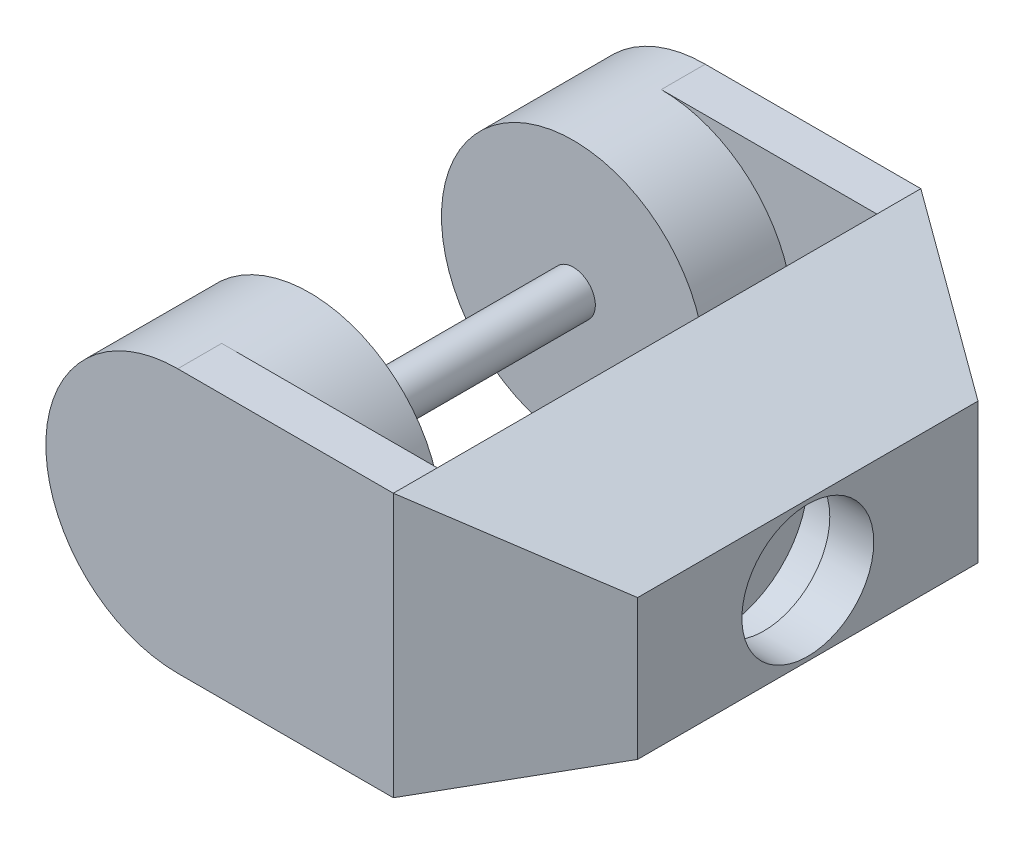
ISO-10303-21;
HEADER;
FILE_DESCRIPTION(('STEP AP214'),'2;1');
FILE_NAME('part.step','',(''),(''),'','','');
FILE_SCHEMA(('AUTOMOTIVE_DESIGN { 1 0 10303 214 1 1 1 1 }'));
ENDSEC;
DATA;
#1=APPLICATION_CONTEXT('core data for automotive mechanical design processes');
#2=APPLICATION_PROTOCOL_DEFINITION('international standard','automotive_design',2000,#1);
#3=PRODUCT_CONTEXT('',#1,'mechanical');
#4=PRODUCT('Part','Part','',(#3));
#5=PRODUCT_RELATED_PRODUCT_CATEGORY('part','',(#4));
#6=PRODUCT_DEFINITION_FORMATION('','',#4);
#7=PRODUCT_DEFINITION_CONTEXT('part definition',#1,'design');
#8=PRODUCT_DEFINITION('design','',#6,#7);
#9=PRODUCT_DEFINITION_SHAPE('','',#8);
#10=(LENGTH_UNIT() NAMED_UNIT(*) SI_UNIT(.MILLI.,.METRE.));
#11=(NAMED_UNIT(*) PLANE_ANGLE_UNIT() SI_UNIT($,.RADIAN.));
#12=(NAMED_UNIT(*) SI_UNIT($,.STERADIAN.) SOLID_ANGLE_UNIT());
#13=UNCERTAINTY_MEASURE_WITH_UNIT(LENGTH_MEASURE(1.E-05),#10,'distance_accuracy_value','');
#14=(GEOMETRIC_REPRESENTATION_CONTEXT(3) GLOBAL_UNCERTAINTY_ASSIGNED_CONTEXT((#13)) GLOBAL_UNIT_ASSIGNED_CONTEXT((#10,
#11,#12)) REPRESENTATION_CONTEXT('',''));
#15=CARTESIAN_POINT('',(0.,0.,0.));
#16=DIRECTION('',(0.,0.,1.));
#17=DIRECTION('',(1.,0.,0.));
#18=AXIS2_PLACEMENT_3D('',#15,#16,#17);
#19=CARTESIAN_POINT('',(0.,0.,-60.));
#20=DIRECTION('',(0.,0.,-1.));
#21=DIRECTION('',(1.,0.,0.));
#22=AXIS2_PLACEMENT_3D('',#19,#20,#21);
#23=PLANE('',#22);
#24=DIRECTION('',(-1.,0.,0.));
#25=VECTOR('',#24,1.);
#26=CARTESIAN_POINT('',(0.,30.,-60.));
#27=LINE('',#26,#25);
#28=CARTESIAN_POINT('',(49.0468505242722,30.,-60.));
#29=VERTEX_POINT('',#28);
#30=CARTESIAN_POINT('',(0.,30.,-60.));
#31=VERTEX_POINT('',#30);
#32=EDGE_CURVE('E167',#29,#31,#27,.T.);
#33=ORIENTED_EDGE('',*,*,#32,.F.);
#34=DIRECTION('',(0.,-1.,0.));
#35=VECTOR('',#34,1.);
#36=CARTESIAN_POINT('',(49.0468505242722,219.533419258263,-60.));
#37=LINE('',#36,#35);
#38=CARTESIAN_POINT('',(49.0468505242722,-30.,-60.));
#39=VERTEX_POINT('',#38);
#40=EDGE_CURVE('E141',#29,#39,#37,.T.);
#41=ORIENTED_EDGE('',*,*,#40,.T.);
#42=DIRECTION('',(1.,0.,0.));
#43=VECTOR('',#42,1.);
#44=CARTESIAN_POINT('',(0.,-30.,-60.));
#45=LINE('',#44,#43);
#46=CARTESIAN_POINT('',(0.,-30.,-60.));
#47=VERTEX_POINT('',#46);
#48=EDGE_CURVE('E171',#47,#39,#45,.T.);
#49=ORIENTED_EDGE('',*,*,#48,.F.);
#50=CARTESIAN_POINT('',(0.,0.,-60.));
#51=DIRECTION('',(0.,0.,1.));
#52=DIRECTION('',(1.,0.,0.));
#53=AXIS2_PLACEMENT_3D('',#50,#51,#52);
#54=CIRCLE('',#53,30.);
#55=EDGE_CURVE('E164',#31,#47,#54,.T.);
#56=ORIENTED_EDGE('',*,*,#55,.F.);
#57=EDGE_LOOP('',(#33,#41,#49,#56));
#58=FACE_BOUND('',#57,.T.);
#59=ADVANCED_FACE('F33',(#58),#23,.T.);
#60=CARTESIAN_POINT('',(49.0468505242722,30.,60.));
#61=DIRECTION('',(-0.379338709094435,-0.925257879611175,0.));
#62=DIRECTION('',(0.925257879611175,-0.379338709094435,0.));
#63=AXIS2_PLACEMENT_3D('',#60,#61,#62);
#64=PLANE('',#63);
#65=DIRECTION('',(0.,0.,-1.));
#66=VECTOR('',#65,1.);
#67=CARTESIAN_POINT('',(49.0468505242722,30.,60.));
#68=LINE('',#67,#66);
#69=CARTESIAN_POINT('',(49.0468505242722,30.,60.));
#70=VERTEX_POINT('',#69);
#71=CARTESIAN_POINT('',(49.0468505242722,30.,50.));
#72=VERTEX_POINT('',#71);
#73=EDGE_CURVE('E123',#70,#72,#68,.T.);
#74=ORIENTED_EDGE('',*,*,#73,.F.);
#75=DIRECTION('',(0.802330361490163,-0.328940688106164,-0.49806025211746));
#76=VECTOR('',#75,1.);
#77=CARTESIAN_POINT('',(49.0468505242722,30.,60.));
#78=LINE('',#77,#76);
#79=CARTESIAN_POINT('',(83.3345763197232,15.9426631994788,38.7153095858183));
#80=VERTEX_POINT('',#79);
#81=EDGE_CURVE('E56',#70,#80,#78,.T.);
#82=ORIENTED_EDGE('',*,*,#81,.T.);
#83=DIRECTION('',(0.,0.,-1.));
#84=VECTOR('',#83,1.);
#85=CARTESIAN_POINT('',(83.3345763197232,15.9426631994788,60.));
#86=LINE('',#85,#84);
#87=CARTESIAN_POINT('',(83.3345763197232,15.9426631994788,-38.7153095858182));
#88=VERTEX_POINT('',#87);
#89=EDGE_CURVE('E152',#80,#88,#86,.T.);
#90=ORIENTED_EDGE('',*,*,#89,.T.);
#91=DIRECTION('',(0.802330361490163,-0.328940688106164,0.49806025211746));
#92=VECTOR('',#91,1.);
#93=CARTESIAN_POINT('',(96.9999139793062,10.3401261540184,-30.2323182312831));
#94=LINE('',#93,#92);
#95=EDGE_CURVE('E149',#29,#88,#94,.T.);
#96=ORIENTED_EDGE('',*,*,#95,.F.);
#97=DIRECTION('',(0.,0.,1.));
#98=VECTOR('',#97,1.);
#99=CARTESIAN_POINT('',(49.0468505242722,30.,-60.));
#100=LINE('',#99,#98);
#101=CARTESIAN_POINT('',(49.0468505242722,30.,-50.));
#102=VERTEX_POINT('',#101);
#103=EDGE_CURVE('E187',#29,#102,#100,.T.);
#104=ORIENTED_EDGE('',*,*,#103,.T.);
#105=DIRECTION('',(0.,0.,-1.));
#106=VECTOR('',#105,1.);
#107=CARTESIAN_POINT('',(49.0468505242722,30.,60.));
#108=LINE('',#107,#106);
#109=EDGE_CURVE('E161',#72,#102,#108,.T.);
#110=ORIENTED_EDGE('',*,*,#109,.F.);
#111=EDGE_LOOP('',(#74,#82,#90,#96,#104,#110));
#112=FACE_BOUND('',#111,.T.);
#113=ADVANCED_FACE('F257',(#112),#64,.F.);
#114=CARTESIAN_POINT('',(49.0468505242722,-30.,60.));
#115=DIRECTION('',(-0.379338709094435,0.925257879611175,0.));
#116=DIRECTION('',(-0.925257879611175,-0.379338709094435,0.));
#117=AXIS2_PLACEMENT_3D('',#114,#115,#116);
#118=PLANE('',#117);
#119=DIRECTION('',(0.,0.,-1.));
#120=VECTOR('',#119,1.);
#121=CARTESIAN_POINT('',(83.3345763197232,-15.9426631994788,60.));
#122=LINE('',#121,#120);
#123=CARTESIAN_POINT('',(83.3345763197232,-15.9426631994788,38.7153095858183));
#124=VERTEX_POINT('',#123);
#125=CARTESIAN_POINT('',(83.3345763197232,-15.9426631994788,-38.7153095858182));
#126=VERTEX_POINT('',#125);
#127=EDGE_CURVE('E137',#124,#126,#122,.T.);
#128=ORIENTED_EDGE('',*,*,#127,.F.);
#129=DIRECTION('',(-0.802330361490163,-0.328940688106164,0.49806025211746));
#130=VECTOR('',#129,1.);
#131=CARTESIAN_POINT('',(49.0468505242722,-30.,60.));
#132=LINE('',#131,#130);
#133=CARTESIAN_POINT('',(49.0468505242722,-30.,60.));
#134=VERTEX_POINT('',#133);
#135=EDGE_CURVE('E134',#124,#134,#132,.T.);
#136=ORIENTED_EDGE('',*,*,#135,.T.);
#137=DIRECTION('',(0.,0.,-1.));
#138=VECTOR('',#137,1.);
#139=CARTESIAN_POINT('',(49.0468505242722,-30.,60.));
#140=LINE('',#139,#138);
#141=CARTESIAN_POINT('',(49.0468505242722,-30.,50.));
#142=VERTEX_POINT('',#141);
#143=EDGE_CURVE('E110',#134,#142,#140,.T.);
#144=ORIENTED_EDGE('',*,*,#143,.T.);
#145=DIRECTION('',(0.,0.,-1.));
#146=VECTOR('',#145,1.);
#147=CARTESIAN_POINT('',(49.0468505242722,-30.,60.));
#148=LINE('',#147,#146);
#149=CARTESIAN_POINT('',(49.0468505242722,-30.,-50.));
#150=VERTEX_POINT('',#149);
#151=EDGE_CURVE('E155',#142,#150,#148,.T.);
#152=ORIENTED_EDGE('',*,*,#151,.T.);
#153=DIRECTION('',(0.,0.,1.));
#154=VECTOR('',#153,1.);
#155=CARTESIAN_POINT('',(49.0468505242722,-30.,-60.));
#156=LINE('',#155,#154);
#157=EDGE_CURVE('E184',#39,#150,#156,.T.);
#158=ORIENTED_EDGE('',*,*,#157,.F.);
#159=DIRECTION('',(-0.802330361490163,-0.328940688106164,-0.49806025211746));
#160=VECTOR('',#159,1.);
#161=CARTESIAN_POINT('',(96.9999139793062,-10.3401261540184,-30.2323182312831));
#162=LINE('',#161,#160);
#163=EDGE_CURVE('E143',#126,#39,#162,.T.);
#164=ORIENTED_EDGE('',*,*,#163,.F.);
#165=EDGE_LOOP('',(#128,#136,#144,#152,#158,#164));
#166=FACE_BOUND('',#165,.T.);
#167=ADVANCED_FACE('F135',(#166),#118,.F.);
#168=CARTESIAN_POINT('',(83.3345763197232,15.9426631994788,60.));
#169=DIRECTION('',(-1.,0.,0.));
#170=DIRECTION('',(0.,0.,1.));
#171=AXIS2_PLACEMENT_3D('',#168,#169,#170);
#172=PLANE('',#171);
#173=CARTESIAN_POINT('',(83.3345763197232,0.,0.));
#174=DIRECTION('',(1.,0.,0.));
#175=DIRECTION('',(0.,0.,-1.));
#176=AXIS2_PLACEMENT_3D('',#173,#174,#175);
#177=CIRCLE('',#176,15.);
#178=CARTESIAN_POINT('',(83.3345763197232,0.,-15.));
#179=VERTEX_POINT('',#178);
#180=EDGE_CURVE('E512',#179,#179,#177,.T.);
#181=ORIENTED_EDGE('',*,*,#180,.F.);
#182=EDGE_LOOP('',(#181));
#183=FACE_BOUND('',#182,.T.);
#184=ORIENTED_EDGE('',*,*,#89,.F.);
#185=DIRECTION('',(0.,-1.,0.));
#186=VECTOR('',#185,1.);
#187=CARTESIAN_POINT('',(83.3345763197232,15.9426631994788,38.7153095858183));
#188=LINE('',#187,#186);
#189=EDGE_CURVE('E48',#80,#124,#188,.T.);
#190=ORIENTED_EDGE('',*,*,#189,.T.);
#191=ORIENTED_EDGE('',*,*,#127,.T.);
#192=DIRECTION('',(0.,-1.,0.));
#193=VECTOR('',#192,1.);
#194=CARTESIAN_POINT('',(83.3345763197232,15.9426631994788,-38.7153095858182));
#195=LINE('',#194,#193);
#196=EDGE_CURVE('E41',#88,#126,#195,.T.);
#197=ORIENTED_EDGE('',*,*,#196,.F.);
#198=EDGE_LOOP('',(#184,#190,#191,#197));
#199=FACE_BOUND('',#198,.T.);
#200=ADVANCED_FACE('F279',(#183,#199),#172,.F.);
#201=CARTESIAN_POINT('',(0.,0.,30.));
#202=DIRECTION('',(0.,0.,-1.));
#203=DIRECTION('',(-1.,0.,0.));
#204=AXIS2_PLACEMENT_3D('',#201,#202,#203);
#205=CYLINDRICAL_SURFACE('',#204,5.);
#206=CARTESIAN_POINT('',(0.,0.,30.));
#207=DIRECTION('',(0.,0.,1.));
#208=DIRECTION('',(1.,0.,0.));
#209=AXIS2_PLACEMENT_3D('',#206,#207,#208);
#210=CIRCLE('',#209,5.);
#211=CARTESIAN_POINT('',(5.,0.,30.));
#212=VERTEX_POINT('',#211);
#213=EDGE_CURVE('E214',#212,#212,#210,.T.);
#214=ORIENTED_EDGE('',*,*,#213,.F.);
#215=EDGE_LOOP('',(#214));
#216=FACE_BOUND('',#215,.T.);
#217=CARTESIAN_POINT('',(0.,0.,-30.));
#218=DIRECTION('',(0.,0.,-1.));
#219=DIRECTION('',(-1.,0.,0.));
#220=AXIS2_PLACEMENT_3D('',#217,#218,#219);
#221=CIRCLE('',#220,5.);
#222=CARTESIAN_POINT('',(-5.,0.,-30.));
#223=VERTEX_POINT('',#222);
#224=EDGE_CURVE('E207',#223,#223,#221,.T.);
#225=ORIENTED_EDGE('',*,*,#224,.F.);
#226=EDGE_LOOP('',(#225));
#227=FACE_BOUND('',#226,.T.);
#228=ADVANCED_FACE('F35',(#216,#227),#205,.T.);
#229=CARTESIAN_POINT('',(0.,0.,30.));
#230=DIRECTION('',(0.,0.,1.));
#231=DIRECTION('',(1.,0.,0.));
#232=AXIS2_PLACEMENT_3D('',#229,#230,#231);
#233=PLANE('',#232);
#234=CARTESIAN_POINT('',(0.,0.,30.));
#235=DIRECTION('',(0.,0.,1.));
#236=DIRECTION('',(1.,0.,0.));
#237=AXIS2_PLACEMENT_3D('',#234,#235,#236);
#238=CIRCLE('',#237,30.);
#239=CARTESIAN_POINT('',(30.,0.,30.));
#240=VERTEX_POINT('',#239);
#241=EDGE_CURVE('E210',#240,#240,#238,.T.);
#242=ORIENTED_EDGE('',*,*,#241,.F.);
#243=EDGE_LOOP('',(#242));
#244=FACE_BOUND('',#243,.T.);
#245=ORIENTED_EDGE('',*,*,#213,.T.);
#246=EDGE_LOOP('',(#245));
#247=FACE_BOUND('',#246,.T.);
#248=ADVANCED_FACE('F287',(#244,#247),#233,.F.);
#249=CARTESIAN_POINT('',(0.,0.,50.));
#250=DIRECTION('',(0.,0.,-1.));
#251=DIRECTION('',(-1.,0.,0.));
#252=AXIS2_PLACEMENT_3D('',#249,#250,#251);
#253=CYLINDRICAL_SURFACE('',#252,30.);
#254=CARTESIAN_POINT('',(0.,0.,50.));
#255=DIRECTION('',(0.,0.,1.));
#256=DIRECTION('',(1.,0.,0.));
#257=AXIS2_PLACEMENT_3D('',#254,#255,#256);
#258=CIRCLE('',#257,30.);
#259=CARTESIAN_POINT('',(0.,-30.,50.));
#260=VERTEX_POINT('',#259);
#261=CARTESIAN_POINT('',(0.,30.,50.));
#262=VERTEX_POINT('',#261);
#263=EDGE_CURVE('E213',#260,#262,#258,.T.);
#264=ORIENTED_EDGE('',*,*,#263,.F.);
#265=DIRECTION('',(0.,0.,-1.));
#266=VECTOR('',#265,1.);
#267=CARTESIAN_POINT('',(0.,-30.,60.));
#268=LINE('',#267,#266);
#269=CARTESIAN_POINT('',(0.,-30.,60.));
#270=VERTEX_POINT('',#269);
#271=EDGE_CURVE('E122',#270,#260,#268,.T.);
#272=ORIENTED_EDGE('',*,*,#271,.F.);
#273=CARTESIAN_POINT('',(0.,0.,60.));
#274=DIRECTION('',(0.,0.,1.));
#275=DIRECTION('',(1.,0.,0.));
#276=AXIS2_PLACEMENT_3D('',#273,#274,#275);
#277=CIRCLE('',#276,30.);
#278=CARTESIAN_POINT('',(0.,30.,60.));
#279=VERTEX_POINT('',#278);
#280=EDGE_CURVE('E129',#279,#270,#277,.T.);
#281=ORIENTED_EDGE('',*,*,#280,.F.);
#282=DIRECTION('',(0.,0.,-1.));
#283=VECTOR('',#282,1.);
#284=CARTESIAN_POINT('',(0.,30.,60.));
#285=LINE('',#284,#283);
#286=EDGE_CURVE('E192',#279,#262,#285,.T.);
#287=ORIENTED_EDGE('',*,*,#286,.T.);
#288=EDGE_LOOP('',(#264,#272,#281,#287));
#289=FACE_BOUND('',#288,.T.);
#290=ORIENTED_EDGE('',*,*,#241,.T.);
#291=EDGE_LOOP('',(#290));
#292=FACE_BOUND('',#291,.T.);
#293=ADVANCED_FACE('F322',(#289,#292),#253,.T.);
#294=CARTESIAN_POINT('',(0.,0.,-30.));
#295=DIRECTION('',(0.,0.,-1.));
#296=DIRECTION('',(1.,0.,0.));
#297=AXIS2_PLACEMENT_3D('',#294,#295,#296);
#298=PLANE('',#297);
#299=CARTESIAN_POINT('',(0.,0.,-30.));
#300=DIRECTION('',(0.,0.,1.));
#301=DIRECTION('',(1.,0.,0.));
#302=AXIS2_PLACEMENT_3D('',#299,#300,#301);
#303=CIRCLE('',#302,30.);
#304=CARTESIAN_POINT('',(30.,0.,-30.));
#305=VERTEX_POINT('',#304);
#306=EDGE_CURVE('E203',#305,#305,#303,.T.);
#307=ORIENTED_EDGE('',*,*,#306,.T.);
#308=EDGE_LOOP('',(#307));
#309=FACE_BOUND('',#308,.T.);
#310=ORIENTED_EDGE('',*,*,#224,.T.);
#311=EDGE_LOOP('',(#310));
#312=FACE_BOUND('',#311,.T.);
#313=ADVANCED_FACE('F319',(#309,#312),#298,.F.);
#314=CARTESIAN_POINT('',(0.,0.,-50.));
#315=DIRECTION('',(0.,0.,1.));
#316=DIRECTION('',(1.,0.,0.));
#317=AXIS2_PLACEMENT_3D('',#314,#315,#316);
#318=CYLINDRICAL_SURFACE('',#317,30.);
#319=CARTESIAN_POINT('',(0.,0.,-50.));
#320=DIRECTION('',(0.,0.,1.));
#321=DIRECTION('',(1.,0.,0.));
#322=AXIS2_PLACEMENT_3D('',#319,#320,#321);
#323=CIRCLE('',#322,30.);
#324=CARTESIAN_POINT('',(0.,-30.,-50.));
#325=VERTEX_POINT('',#324);
#326=CARTESIAN_POINT('',(0.,30.,-50.));
#327=VERTEX_POINT('',#326);
#328=EDGE_CURVE('E206',#325,#327,#323,.T.);
#329=ORIENTED_EDGE('',*,*,#328,.T.);
#330=DIRECTION('',(0.,0.,1.));
#331=VECTOR('',#330,1.);
#332=CARTESIAN_POINT('',(0.,30.,-60.));
#333=LINE('',#332,#331);
#334=EDGE_CURVE('E229',#31,#327,#333,.T.);
#335=ORIENTED_EDGE('',*,*,#334,.F.);
#336=ORIENTED_EDGE('',*,*,#55,.T.);
#337=DIRECTION('',(0.,0.,1.));
#338=VECTOR('',#337,1.);
#339=CARTESIAN_POINT('',(0.,-30.,-60.));
#340=LINE('',#339,#338);
#341=EDGE_CURVE('E174',#47,#325,#340,.T.);
#342=ORIENTED_EDGE('',*,*,#341,.T.);
#343=EDGE_LOOP('',(#329,#335,#336,#342));
#344=FACE_BOUND('',#343,.T.);
#345=ORIENTED_EDGE('',*,*,#306,.F.);
#346=EDGE_LOOP('',(#345));
#347=FACE_BOUND('',#346,.T.);
#348=ADVANCED_FACE('F312',(#344,#347),#318,.T.);
#349=CARTESIAN_POINT('',(0.,0.,50.));
#350=DIRECTION('',(0.,0.,1.));
#351=DIRECTION('',(1.,0.,0.));
#352=AXIS2_PLACEMENT_3D('',#349,#350,#351);
#353=PLANE('',#352);
#354=DIRECTION('',(1.,0.,0.));
#355=VECTOR('',#354,1.);
#356=CARTESIAN_POINT('',(0.,-30.,50.));
#357=LINE('',#356,#355);
#358=EDGE_CURVE('E117',#260,#142,#357,.T.);
#359=ORIENTED_EDGE('',*,*,#358,.F.);
#360=ORIENTED_EDGE('',*,*,#263,.T.);
#361=DIRECTION('',(-1.,0.,0.));
#362=VECTOR('',#361,1.);
#363=CARTESIAN_POINT('',(0.,30.,50.));
#364=LINE('',#363,#362);
#365=EDGE_CURVE('E198',#72,#262,#364,.T.);
#366=ORIENTED_EDGE('',*,*,#365,.F.);
#367=DIRECTION('',(0.,1.,0.));
#368=VECTOR('',#367,1.);
#369=CARTESIAN_POINT('',(49.0468505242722,30.,50.));
#370=LINE('',#369,#368);
#371=EDGE_CURVE('E195',#142,#72,#370,.T.);
#372=ORIENTED_EDGE('',*,*,#371,.F.);
#373=EDGE_LOOP('',(#359,#360,#366,#372));
#374=FACE_BOUND('',#373,.T.);
#375=ADVANCED_FACE('F309',(#374),#353,.F.);
#376=CARTESIAN_POINT('',(0.,-30.,60.));
#377=DIRECTION('',(0.,1.,0.));
#378=DIRECTION('',(0.,0.,1.));
#379=AXIS2_PLACEMENT_3D('',#376,#377,#378);
#380=PLANE('',#379);
#381=ORIENTED_EDGE('',*,*,#358,.T.);
#382=ORIENTED_EDGE('',*,*,#143,.F.);
#383=DIRECTION('',(1.,0.,0.));
#384=VECTOR('',#383,1.);
#385=CARTESIAN_POINT('',(0.,-30.,60.));
#386=LINE('',#385,#384);
#387=EDGE_CURVE('E114',#270,#134,#386,.T.);
#388=ORIENTED_EDGE('',*,*,#387,.F.);
#389=ORIENTED_EDGE('',*,*,#271,.T.);
#390=EDGE_LOOP('',(#381,#382,#388,#389));
#391=FACE_BOUND('',#390,.T.);
#392=ADVANCED_FACE('F112',(#391),#380,.F.);
#393=CARTESIAN_POINT('',(0.,30.,60.));
#394=DIRECTION('',(0.,-1.,0.));
#395=DIRECTION('',(0.,0.,-1.));
#396=AXIS2_PLACEMENT_3D('',#393,#394,#395);
#397=PLANE('',#396);
#398=ORIENTED_EDGE('',*,*,#365,.T.);
#399=ORIENTED_EDGE('',*,*,#286,.F.);
#400=DIRECTION('',(-1.,0.,0.));
#401=VECTOR('',#400,1.);
#402=CARTESIAN_POINT('',(0.,30.,60.));
#403=LINE('',#402,#401);
#404=EDGE_CURVE('E131',#70,#279,#403,.T.);
#405=ORIENTED_EDGE('',*,*,#404,.F.);
#406=ORIENTED_EDGE('',*,*,#73,.T.);
#407=EDGE_LOOP('',(#398,#399,#405,#406));
#408=FACE_BOUND('',#407,.T.);
#409=ADVANCED_FACE('F308',(#408),#397,.F.);
#410=CARTESIAN_POINT('',(0.,0.,60.));
#411=DIRECTION('',(0.,0.,1.));
#412=DIRECTION('',(1.,0.,0.));
#413=AXIS2_PLACEMENT_3D('',#410,#411,#412);
#414=PLANE('',#413);
#415=DIRECTION('',(0.,-1.,0.));
#416=VECTOR('',#415,1.);
#417=CARTESIAN_POINT('',(49.0468505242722,0.,60.));
#418=LINE('',#417,#416);
#419=EDGE_CURVE('E11',#70,#134,#418,.T.);
#420=ORIENTED_EDGE('',*,*,#419,.F.);
#421=ORIENTED_EDGE('',*,*,#404,.T.);
#422=ORIENTED_EDGE('',*,*,#280,.T.);
#423=ORIENTED_EDGE('',*,*,#387,.T.);
#424=EDGE_LOOP('',(#420,#421,#422,#423));
#425=FACE_BOUND('',#424,.T.);
#426=ADVANCED_FACE('F126',(#425),#414,.T.);
#427=CARTESIAN_POINT('',(0.,30.,-60.));
#428=DIRECTION('',(0.,1.,0.));
#429=DIRECTION('',(0.,0.,1.));
#430=AXIS2_PLACEMENT_3D('',#427,#428,#429);
#431=PLANE('',#430);
#432=DIRECTION('',(-1.,0.,0.));
#433=VECTOR('',#432,1.);
#434=CARTESIAN_POINT('',(0.,30.,-50.));
#435=LINE('',#434,#433);
#436=EDGE_CURVE('E163',#102,#327,#435,.T.);
#437=ORIENTED_EDGE('',*,*,#436,.F.);
#438=ORIENTED_EDGE('',*,*,#103,.F.);
#439=ORIENTED_EDGE('',*,*,#32,.T.);
#440=ORIENTED_EDGE('',*,*,#334,.T.);
#441=EDGE_LOOP('',(#437,#438,#439,#440));
#442=FACE_BOUND('',#441,.T.);
#443=ADVANCED_FACE('F260',(#442),#431,.T.);
#444=CARTESIAN_POINT('',(0.,-30.,-60.));
#445=DIRECTION('',(0.,-1.,0.));
#446=DIRECTION('',(0.,0.,-1.));
#447=AXIS2_PLACEMENT_3D('',#444,#445,#446);
#448=PLANE('',#447);
#449=DIRECTION('',(1.,0.,0.));
#450=VECTOR('',#449,1.);
#451=CARTESIAN_POINT('',(0.,-30.,-50.));
#452=LINE('',#451,#450);
#453=EDGE_CURVE('E168',#325,#150,#452,.T.);
#454=ORIENTED_EDGE('',*,*,#453,.F.);
#455=ORIENTED_EDGE('',*,*,#341,.F.);
#456=ORIENTED_EDGE('',*,*,#48,.T.);
#457=ORIENTED_EDGE('',*,*,#157,.T.);
#458=EDGE_LOOP('',(#454,#455,#456,#457));
#459=FACE_BOUND('',#458,.T.);
#460=ADVANCED_FACE('F269',(#459),#448,.T.);
#461=CARTESIAN_POINT('',(0.,0.,-50.));
#462=DIRECTION('',(0.,0.,-1.));
#463=DIRECTION('',(1.,0.,0.));
#464=AXIS2_PLACEMENT_3D('',#461,#462,#463);
#465=PLANE('',#464);
#466=ORIENTED_EDGE('',*,*,#328,.F.);
#467=ORIENTED_EDGE('',*,*,#453,.T.);
#468=DIRECTION('',(0.,1.,0.));
#469=VECTOR('',#468,1.);
#470=CARTESIAN_POINT('',(49.0468505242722,30.,-50.));
#471=LINE('',#470,#469);
#472=EDGE_CURVE('E178',#150,#102,#471,.T.);
#473=ORIENTED_EDGE('',*,*,#472,.T.);
#474=ORIENTED_EDGE('',*,*,#436,.T.);
#475=EDGE_LOOP('',(#466,#467,#473,#474));
#476=FACE_BOUND('',#475,.T.);
#477=ADVANCED_FACE('F262',(#476),#465,.F.);
#478=CARTESIAN_POINT('',(49.0468505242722,-30.,60.));
#479=DIRECTION('',(1.,0.,0.));
#480=DIRECTION('',(0.,0.,-1.));
#481=AXIS2_PLACEMENT_3D('',#478,#479,#480);
#482=PLANE('',#481);
#483=ORIENTED_EDGE('',*,*,#151,.F.);
#484=ORIENTED_EDGE('',*,*,#371,.T.);
#485=ORIENTED_EDGE('',*,*,#109,.T.);
#486=ORIENTED_EDGE('',*,*,#472,.F.);
#487=EDGE_LOOP('',(#483,#484,#485,#486));
#488=FACE_BOUND('',#487,.T.);
#489=ADVANCED_FACE('F266',(#488),#482,.F.);
#490=CARTESIAN_POINT('',(49.0468505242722,219.533419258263,-60.));
#491=DIRECTION('',(0.527410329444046,0.,-0.849610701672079));
#492=DIRECTION('',(-0.849610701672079,0.,-0.527410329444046));
#493=AXIS2_PLACEMENT_3D('',#490,#491,#492);
#494=PLANE('',#493);
#495=ORIENTED_EDGE('',*,*,#40,.F.);
#496=ORIENTED_EDGE('',*,*,#95,.T.);
#497=ORIENTED_EDGE('',*,*,#196,.T.);
#498=ORIENTED_EDGE('',*,*,#163,.T.);
#499=EDGE_LOOP('',(#495,#496,#497,#498));
#500=FACE_BOUND('',#499,.T.);
#501=ADVANCED_FACE('F276',(#500),#494,.T.);
#502=CARTESIAN_POINT('',(49.0468505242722,257.033419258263,60.));
#503=DIRECTION('',(-0.527410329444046,0.,-0.849610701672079));
#504=DIRECTION('',(-0.849610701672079,0.,0.527410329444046));
#505=AXIS2_PLACEMENT_3D('',#502,#503,#504);
#506=PLANE('',#505);
#507=ORIENTED_EDGE('',*,*,#81,.F.);
#508=ORIENTED_EDGE('',*,*,#419,.T.);
#509=ORIENTED_EDGE('',*,*,#135,.F.);
#510=ORIENTED_EDGE('',*,*,#189,.F.);
#511=EDGE_LOOP('',(#507,#508,#509,#510));
#512=FACE_BOUND('',#511,.T.);
#513=ADVANCED_FACE('F140',(#512),#506,.F.);
#514=CARTESIAN_POINT('',(73.3345763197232,0.,0.));
#515=DIRECTION('',(1.,0.,0.));
#516=DIRECTION('',(0.,0.,-1.));
#517=AXIS2_PLACEMENT_3D('',#514,#515,#516);
#518=CYLINDRICAL_SURFACE('',#517,15.);
#519=CARTESIAN_POINT('',(73.3345763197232,0.,0.));
#520=DIRECTION('',(1.,0.,0.));
#521=DIRECTION('',(0.,0.,-1.));
#522=AXIS2_PLACEMENT_3D('',#519,#520,#521);
#523=CIRCLE('',#522,15.);
#524=CARTESIAN_POINT('',(73.3345763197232,0.,-15.));
#525=VERTEX_POINT('',#524);
#526=EDGE_CURVE('E508',#525,#525,#523,.F.);
#527=ORIENTED_EDGE('',*,*,#526,.T.);
#528=EDGE_LOOP('',(#527));
#529=FACE_BOUND('',#528,.T.);
#530=ORIENTED_EDGE('',*,*,#180,.T.);
#531=EDGE_LOOP('',(#530));
#532=FACE_BOUND('',#531,.T.);
#533=ADVANCED_FACE('F397',(#529,#532),#518,.F.);
#534=CARTESIAN_POINT('',(73.3345763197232,0.,0.));
#535=DIRECTION('',(1.,0.,0.));
#536=DIRECTION('',(0.,0.,-1.));
#537=AXIS2_PLACEMENT_3D('',#534,#535,#536);
#538=PLANE('',#537);
#539=CARTESIAN_POINT('',(73.3345763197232,0.,0.));
#540=DIRECTION('',(1.,0.,0.));
#541=DIRECTION('',(0.,0.,-1.));
#542=AXIS2_PLACEMENT_3D('',#539,#540,#541);
#543=CIRCLE('',#542,20.);
#544=CARTESIAN_POINT('',(73.3345763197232,0.,-20.));
#545=VERTEX_POINT('',#544);
#546=EDGE_CURVE('E509',#545,#545,#543,.T.);
#547=ORIENTED_EDGE('',*,*,#546,.F.);
#548=EDGE_LOOP('',(#547));
#549=FACE_BOUND('',#548,.T.);
#550=ORIENTED_EDGE('',*,*,#526,.F.);
#551=EDGE_LOOP('',(#550));
#552=FACE_BOUND('',#551,.T.);
#553=ADVANCED_FACE('F404',(#549,#552),#538,.F.);
#554=CARTESIAN_POINT('',(63.3345763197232,0.,0.));
#555=DIRECTION('',(1.,0.,0.));
#556=DIRECTION('',(0.,0.,-1.));
#557=AXIS2_PLACEMENT_3D('',#554,#555,#556);
#558=CYLINDRICAL_SURFACE('',#557,20.);
#559=CARTESIAN_POINT('',(63.3345763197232,0.,0.));
#560=DIRECTION('',(1.,0.,0.));
#561=DIRECTION('',(0.,0.,-1.));
#562=AXIS2_PLACEMENT_3D('',#559,#560,#561);
#563=CIRCLE('',#562,20.);
#564=CARTESIAN_POINT('',(63.3345763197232,0.,-20.));
#565=VERTEX_POINT('',#564);
#566=EDGE_CURVE('E507',#565,#565,#563,.T.);
#567=ORIENTED_EDGE('',*,*,#566,.F.);
#568=EDGE_LOOP('',(#567));
#569=FACE_BOUND('',#568,.T.);
#570=ORIENTED_EDGE('',*,*,#546,.T.);
#571=EDGE_LOOP('',(#570));
#572=FACE_BOUND('',#571,.T.);
#573=ADVANCED_FACE('F412',(#569,#572),#558,.F.);
#574=CARTESIAN_POINT('',(63.3345763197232,0.,0.));
#575=DIRECTION('',(1.,0.,0.));
#576=DIRECTION('',(0.,0.,-1.));
#577=AXIS2_PLACEMENT_3D('',#574,#575,#576);
#578=PLANE('',#577);
#579=ORIENTED_EDGE('',*,*,#566,.T.);
#580=EDGE_LOOP('',(#579));
#581=FACE_BOUND('',#580,.T.);
#582=ADVANCED_FACE('F420',(#581),#578,.T.);
#583=CLOSED_SHELL('',(#59,#113,#167,#200,#228,#248,#293,#313,#348,#375,#392,#409,#426,#443,#460,
#477,#489,#501,#513,#533,#553,#573,#582));
#584=MANIFOLD_SOLID_BREP('B2',#583);
#585=ADVANCED_BREP_SHAPE_REPRESENTATION('',(#18,#584),#14);
#586=SHAPE_DEFINITION_REPRESENTATION(#9,#585);
ENDSEC;
END-ISO-10303-21;
